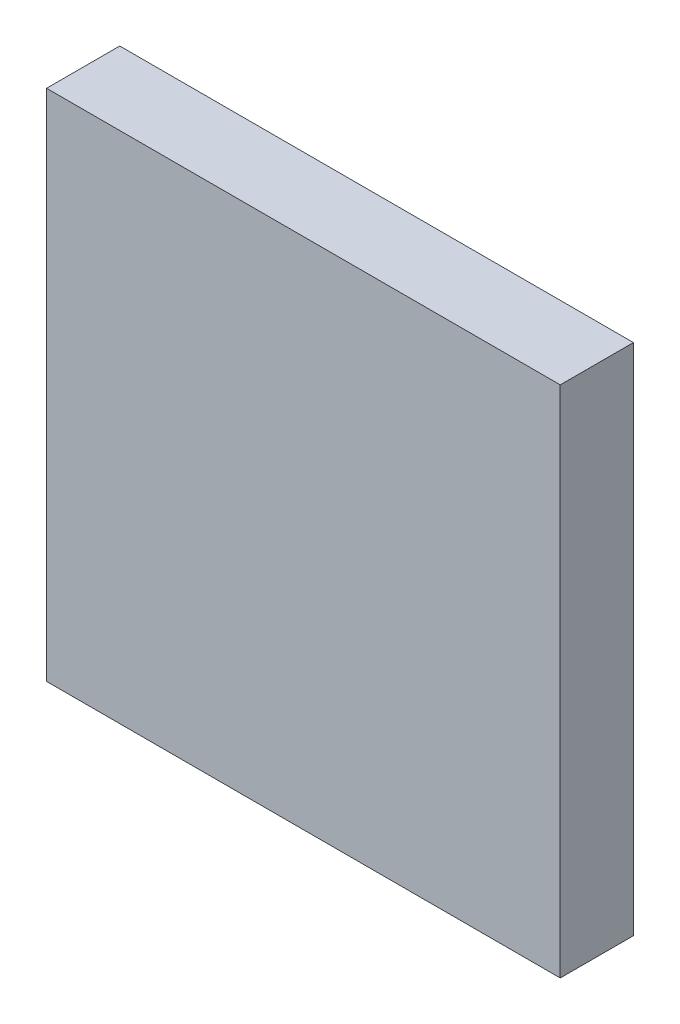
from build123d import *

# Parameters (mm, degrees)
SKETCH1_W           = 40
SKETCH1_H           = 40
BOSS_EXTRUDE1_DEPTH = 5.7


with BuildPart() as part:
    # Sketch1 → Boss-Extrude1 (new body)
    with BuildSketch(Plane.XY):
        with Locations((254.256401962, 56.816608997)):
            Rectangle(SKETCH1_W, SKETCH1_H)
    extrude(amount=BOSS_EXTRUDE1_DEPTH)


solid = part.part
